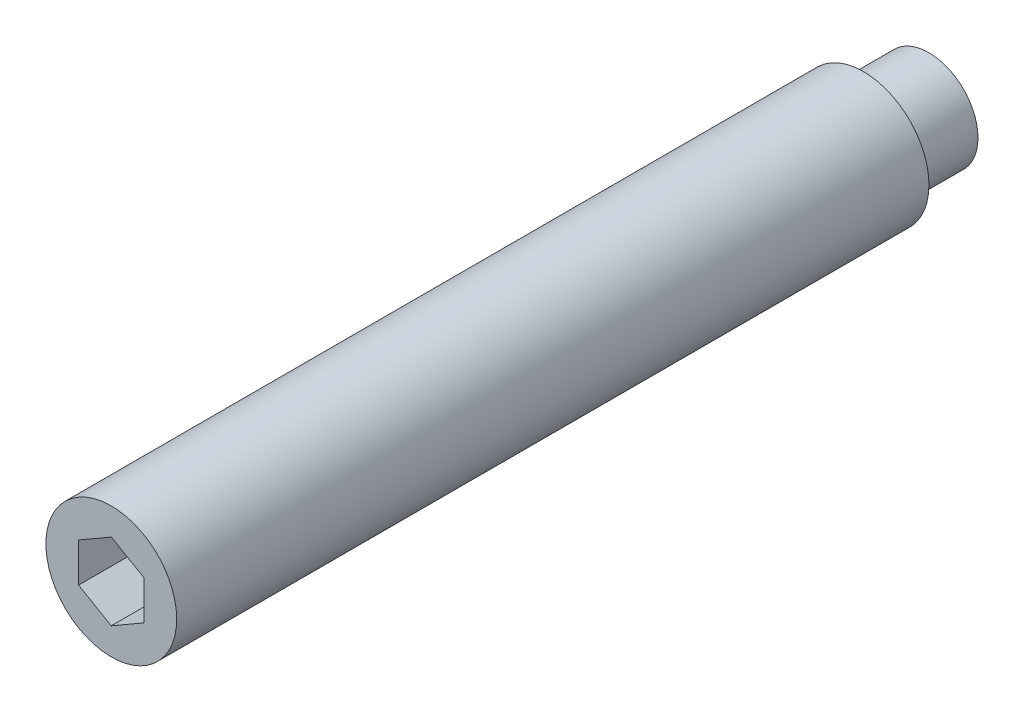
ISO-10303-21;
HEADER;
FILE_DESCRIPTION(('STEP AP214'),'2;1');
FILE_NAME('part.step','',(''),(''),'','','');
FILE_SCHEMA(('AUTOMOTIVE_DESIGN { 1 0 10303 214 1 1 1 1 }'));
ENDSEC;
DATA;
#1=APPLICATION_CONTEXT('core data for automotive mechanical design processes');
#2=APPLICATION_PROTOCOL_DEFINITION('international standard','automotive_design',2000,#1);
#3=PRODUCT_CONTEXT('',#1,'mechanical');
#4=PRODUCT('Part','Part','',(#3));
#5=PRODUCT_RELATED_PRODUCT_CATEGORY('part','',(#4));
#6=PRODUCT_DEFINITION_FORMATION('','',#4);
#7=PRODUCT_DEFINITION_CONTEXT('part definition',#1,'design');
#8=PRODUCT_DEFINITION('design','',#6,#7);
#9=PRODUCT_DEFINITION_SHAPE('','',#8);
#10=(LENGTH_UNIT() NAMED_UNIT(*) SI_UNIT(.MILLI.,.METRE.));
#11=(NAMED_UNIT(*) PLANE_ANGLE_UNIT() SI_UNIT($,.RADIAN.));
#12=(NAMED_UNIT(*) SI_UNIT($,.STERADIAN.) SOLID_ANGLE_UNIT());
#13=UNCERTAINTY_MEASURE_WITH_UNIT(LENGTH_MEASURE(1.E-05),#10,'distance_accuracy_value','');
#14=(GEOMETRIC_REPRESENTATION_CONTEXT(3) GLOBAL_UNCERTAINTY_ASSIGNED_CONTEXT((#13)) GLOBAL_UNIT_ASSIGNED_CONTEXT((#10,
#11,#12)) REPRESENTATION_CONTEXT('',''));
#15=CARTESIAN_POINT('',(0.,0.,0.));
#16=DIRECTION('',(0.,0.,1.));
#17=DIRECTION('',(1.,0.,0.));
#18=AXIS2_PLACEMENT_3D('',#15,#16,#17);
#19=CARTESIAN_POINT('',(0.,4.7,94.));
#20=DIRECTION('',(-0.5,-0.866025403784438,0.));
#21=DIRECTION('',(0.866025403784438,-0.5,0.));
#22=AXIS2_PLACEMENT_3D('',#19,#20,#21);
#23=PLANE('',#22);
#24=DIRECTION('',(0.,0.,1.));
#25=VECTOR('',#24,1.);
#26=CARTESIAN_POINT('',(4.,2.39059892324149,94.));
#27=LINE('',#26,#25);
#28=CARTESIAN_POINT('',(4.,2.39059892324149,94.));
#29=VERTEX_POINT('',#28);
#30=CARTESIAN_POINT('',(4.,2.39059892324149,100.));
#31=VERTEX_POINT('',#30);
#32=EDGE_CURVE('E37',#29,#31,#27,.T.);
#33=ORIENTED_EDGE('',*,*,#32,.T.);
#34=DIRECTION('',(0.866025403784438,-0.5,0.));
#35=VECTOR('',#34,1.);
#36=CARTESIAN_POINT('',(0.,4.7,100.));
#37=LINE('',#36,#35);
#38=CARTESIAN_POINT('',(0.,4.7,100.));
#39=VERTEX_POINT('',#38);
#40=EDGE_CURVE('E29',#39,#31,#37,.T.);
#41=ORIENTED_EDGE('',*,*,#40,.F.);
#42=DIRECTION('',(0.,0.,1.));
#43=VECTOR('',#42,1.);
#44=CARTESIAN_POINT('',(0.,4.7,94.));
#45=LINE('',#44,#43);
#46=CARTESIAN_POINT('',(0.,4.7,94.));
#47=VERTEX_POINT('',#46);
#48=EDGE_CURVE('E93',#47,#39,#45,.T.);
#49=ORIENTED_EDGE('',*,*,#48,.F.);
#50=DIRECTION('',(0.866025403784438,-0.5,0.));
#51=VECTOR('',#50,1.);
#52=CARTESIAN_POINT('',(0.,4.7,94.));
#53=LINE('',#52,#51);
#54=EDGE_CURVE('E96',#47,#29,#53,.T.);
#55=ORIENTED_EDGE('',*,*,#54,.T.);
#56=EDGE_LOOP('',(#33,#41,#49,#55));
#57=FACE_BOUND('',#56,.T.);
#58=ADVANCED_FACE('F14',(#57),#23,.T.);
#59=CARTESIAN_POINT('',(4.,2.39059892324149,94.));
#60=DIRECTION('',(-1.,0.,0.));
#61=DIRECTION('',(0.,0.,1.));
#62=AXIS2_PLACEMENT_3D('',#59,#60,#61);
#63=PLANE('',#62);
#64=DIRECTION('',(0.,0.,1.));
#65=VECTOR('',#64,1.);
#66=CARTESIAN_POINT('',(4.,-2.39059892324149,94.));
#67=LINE('',#66,#65);
#68=CARTESIAN_POINT('',(4.,-2.39059892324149,94.));
#69=VERTEX_POINT('',#68);
#70=CARTESIAN_POINT('',(4.,-2.39059892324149,100.));
#71=VERTEX_POINT('',#70);
#72=EDGE_CURVE('E72',#69,#71,#67,.T.);
#73=ORIENTED_EDGE('',*,*,#72,.T.);
#74=DIRECTION('',(0.,-1.,0.));
#75=VECTOR('',#74,1.);
#76=CARTESIAN_POINT('',(4.,2.39059892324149,100.));
#77=LINE('',#76,#75);
#78=EDGE_CURVE('E234',#31,#71,#77,.T.);
#79=ORIENTED_EDGE('',*,*,#78,.F.);
#80=ORIENTED_EDGE('',*,*,#32,.F.);
#81=DIRECTION('',(0.,-1.,0.));
#82=VECTOR('',#81,1.);
#83=CARTESIAN_POINT('',(4.,2.39059892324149,94.));
#84=LINE('',#83,#82);
#85=EDGE_CURVE('E81',#29,#69,#84,.T.);
#86=ORIENTED_EDGE('',*,*,#85,.T.);
#87=EDGE_LOOP('',(#73,#79,#80,#86));
#88=FACE_BOUND('',#87,.T.);
#89=ADVANCED_FACE('F128',(#88),#63,.T.);
#90=CARTESIAN_POINT('',(0.,-4.7,94.));
#91=DIRECTION('',(0.5,-0.866025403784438,0.));
#92=DIRECTION('',(0.866025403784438,0.5,0.));
#93=AXIS2_PLACEMENT_3D('',#90,#91,#92);
#94=PLANE('',#93);
#95=DIRECTION('',(0.,0.,1.));
#96=VECTOR('',#95,1.);
#97=CARTESIAN_POINT('',(0.,-4.7,94.));
#98=LINE('',#97,#96);
#99=CARTESIAN_POINT('',(0.,-4.7,94.));
#100=VERTEX_POINT('',#99);
#101=CARTESIAN_POINT('',(0.,-4.7,100.));
#102=VERTEX_POINT('',#101);
#103=EDGE_CURVE('E59',#100,#102,#98,.T.);
#104=ORIENTED_EDGE('',*,*,#103,.T.);
#105=DIRECTION('',(0.866025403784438,0.5,0.));
#106=VECTOR('',#105,1.);
#107=CARTESIAN_POINT('',(0.,-4.7,100.));
#108=LINE('',#107,#106);
#109=EDGE_CURVE('E240',#102,#71,#108,.T.);
#110=ORIENTED_EDGE('',*,*,#109,.T.);
#111=ORIENTED_EDGE('',*,*,#72,.F.);
#112=DIRECTION('',(0.866025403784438,0.5,0.));
#113=VECTOR('',#112,1.);
#114=CARTESIAN_POINT('',(0.,-4.7,94.));
#115=LINE('',#114,#113);
#116=EDGE_CURVE('E76',#100,#69,#115,.T.);
#117=ORIENTED_EDGE('',*,*,#116,.F.);
#118=EDGE_LOOP('',(#104,#110,#111,#117));
#119=FACE_BOUND('',#118,.T.);
#120=ADVANCED_FACE('F77',(#119),#94,.F.);
#121=CARTESIAN_POINT('',(0.,-4.7,94.));
#122=DIRECTION('',(0.5,0.866025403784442,0.));
#123=DIRECTION('',(-0.866025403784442,0.5,0.));
#124=AXIS2_PLACEMENT_3D('',#121,#122,#123);
#125=PLANE('',#124);
#126=DIRECTION('',(0.,0.,1.));
#127=VECTOR('',#126,1.);
#128=CARTESIAN_POINT('',(-4.,-2.39059892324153,94.));
#129=LINE('',#128,#127);
#130=CARTESIAN_POINT('',(-4.,-2.39059892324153,94.));
#131=VERTEX_POINT('',#130);
#132=CARTESIAN_POINT('',(-4.,-2.39059892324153,100.));
#133=VERTEX_POINT('',#132);
#134=EDGE_CURVE('E73',#131,#133,#129,.T.);
#135=ORIENTED_EDGE('',*,*,#134,.T.);
#136=DIRECTION('',(-0.866025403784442,0.5,0.));
#137=VECTOR('',#136,1.);
#138=CARTESIAN_POINT('',(0.,-4.7,100.));
#139=LINE('',#138,#137);
#140=EDGE_CURVE('E68',#102,#133,#139,.T.);
#141=ORIENTED_EDGE('',*,*,#140,.F.);
#142=ORIENTED_EDGE('',*,*,#103,.F.);
#143=DIRECTION('',(-0.866025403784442,0.5,0.));
#144=VECTOR('',#143,1.);
#145=CARTESIAN_POINT('',(0.,-4.7,94.));
#146=LINE('',#145,#144);
#147=EDGE_CURVE('E64',#100,#131,#146,.T.);
#148=ORIENTED_EDGE('',*,*,#147,.T.);
#149=EDGE_LOOP('',(#135,#141,#142,#148));
#150=FACE_BOUND('',#149,.T.);
#151=ADVANCED_FACE('F62',(#150),#125,.T.);
#152=CARTESIAN_POINT('',(-4.,2.39059892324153,94.));
#153=DIRECTION('',(-1.,0.,0.));
#154=DIRECTION('',(0.,0.,1.));
#155=AXIS2_PLACEMENT_3D('',#152,#153,#154);
#156=PLANE('',#155);
#157=DIRECTION('',(0.,0.,1.));
#158=VECTOR('',#157,1.);
#159=CARTESIAN_POINT('',(-4.,2.39059892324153,94.));
#160=LINE('',#159,#158);
#161=CARTESIAN_POINT('',(-4.,2.39059892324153,94.));
#162=VERTEX_POINT('',#161);
#163=CARTESIAN_POINT('',(-4.,2.39059892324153,100.));
#164=VERTEX_POINT('',#163);
#165=EDGE_CURVE('E95',#162,#164,#160,.T.);
#166=ORIENTED_EDGE('',*,*,#165,.T.);
#167=DIRECTION('',(0.,-1.,0.));
#168=VECTOR('',#167,1.);
#169=CARTESIAN_POINT('',(-4.,2.39059892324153,100.));
#170=LINE('',#169,#168);
#171=EDGE_CURVE('E245',#164,#133,#170,.T.);
#172=ORIENTED_EDGE('',*,*,#171,.T.);
#173=ORIENTED_EDGE('',*,*,#134,.F.);
#174=DIRECTION('',(0.,-1.,0.));
#175=VECTOR('',#174,1.);
#176=CARTESIAN_POINT('',(-4.,2.39059892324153,94.));
#177=LINE('',#176,#175);
#178=EDGE_CURVE('E87',#162,#131,#177,.T.);
#179=ORIENTED_EDGE('',*,*,#178,.F.);
#180=EDGE_LOOP('',(#166,#172,#173,#179));
#181=FACE_BOUND('',#180,.T.);
#182=ADVANCED_FACE('F139',(#181),#156,.F.);
#183=CARTESIAN_POINT('',(0.,4.7,94.));
#184=DIRECTION('',(-0.499999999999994,0.866025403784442,0.));
#185=DIRECTION('',(-0.866025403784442,-0.499999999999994,0.));
#186=AXIS2_PLACEMENT_3D('',#183,#184,#185);
#187=PLANE('',#186);
#188=DIRECTION('',(-0.866025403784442,-0.499999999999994,0.));
#189=VECTOR('',#188,1.);
#190=CARTESIAN_POINT('',(0.,4.7,94.));
#191=LINE('',#190,#189);
#192=EDGE_CURVE('E89',#47,#162,#191,.T.);
#193=ORIENTED_EDGE('',*,*,#192,.F.);
#194=ORIENTED_EDGE('',*,*,#48,.T.);
#195=DIRECTION('',(-0.866025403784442,-0.499999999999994,0.));
#196=VECTOR('',#195,1.);
#197=CARTESIAN_POINT('',(0.,4.7,100.));
#198=LINE('',#197,#196);
#199=EDGE_CURVE('E237',#39,#164,#198,.T.);
#200=ORIENTED_EDGE('',*,*,#199,.T.);
#201=ORIENTED_EDGE('',*,*,#165,.F.);
#202=EDGE_LOOP('',(#193,#194,#200,#201));
#203=FACE_BOUND('',#202,.T.);
#204=ADVANCED_FACE('F126',(#203),#187,.F.);
#205=CARTESIAN_POINT('',(8.1406387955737,0.,94.));
#206=DIRECTION('',(0.,0.,1.));
#207=DIRECTION('',(1.,0.,0.));
#208=AXIS2_PLACEMENT_3D('',#205,#206,#207);
#209=PLANE('',#208);
#210=ORIENTED_EDGE('',*,*,#54,.F.);
#211=ORIENTED_EDGE('',*,*,#192,.T.);
#212=ORIENTED_EDGE('',*,*,#178,.T.);
#213=ORIENTED_EDGE('',*,*,#147,.F.);
#214=ORIENTED_EDGE('',*,*,#116,.T.);
#215=ORIENTED_EDGE('',*,*,#85,.F.);
#216=EDGE_LOOP('',(#210,#211,#212,#213,#214,#215));
#217=FACE_BOUND('',#216,.T.);
#218=ADVANCED_FACE('F84',(#217),#209,.T.);
#219=CARTESIAN_POINT('',(8.,0.,100.));
#220=DIRECTION('',(0.,0.,-1.));
#221=DIRECTION('',(-1.,0.,0.));
#222=AXIS2_PLACEMENT_3D('',#219,#220,#221);
#223=PLANE('',#222);
#224=CARTESIAN_POINT('',(0.,0.,100.));
#225=DIRECTION('',(0.,0.,1.));
#226=DIRECTION('',(1.,0.,0.));
#227=AXIS2_PLACEMENT_3D('',#224,#225,#226);
#228=CIRCLE('',#227,8.);
#229=CARTESIAN_POINT('',(8.,0.,100.));
#230=VERTEX_POINT('',#229);
#231=EDGE_CURVE('E102',#230,#230,#228,.T.);
#232=ORIENTED_EDGE('',*,*,#231,.T.);
#233=EDGE_LOOP('',(#232));
#234=FACE_BOUND('',#233,.T.);
#235=ORIENTED_EDGE('',*,*,#40,.T.);
#236=ORIENTED_EDGE('',*,*,#78,.T.);
#237=ORIENTED_EDGE('',*,*,#109,.F.);
#238=ORIENTED_EDGE('',*,*,#140,.T.);
#239=ORIENTED_EDGE('',*,*,#171,.F.);
#240=ORIENTED_EDGE('',*,*,#199,.F.);
#241=EDGE_LOOP('',(#235,#236,#237,#238,#239,#240));
#242=FACE_BOUND('',#241,.T.);
#243=ADVANCED_FACE('F118',(#234,#242),#223,.F.);
#244=CARTESIAN_POINT('',(0.,0.,0.));
#245=DIRECTION('',(0.,0.,1.));
#246=DIRECTION('',(1.,0.,0.));
#247=AXIS2_PLACEMENT_3D('',#244,#245,#246);
#248=PLANE('',#247);
#249=CARTESIAN_POINT('',(0.,0.,0.));
#250=DIRECTION('',(0.,0.,1.));
#251=DIRECTION('',(1.,0.,0.));
#252=AXIS2_PLACEMENT_3D('',#249,#250,#251);
#253=CIRCLE('',#252,6.);
#254=CARTESIAN_POINT('',(6.,0.,0.));
#255=VERTEX_POINT('',#254);
#256=EDGE_CURVE('E9',#255,#255,#253,.T.);
#257=ORIENTED_EDGE('',*,*,#256,.F.);
#258=EDGE_LOOP('',(#257));
#259=FACE_BOUND('',#258,.T.);
#260=ADVANCED_FACE('F16',(#259),#248,.F.);
#261=CARTESIAN_POINT('',(0.,0.,110.));
#262=DIRECTION('',(0.,0.,1.));
#263=DIRECTION('',(1.,0.,0.));
#264=AXIS2_PLACEMENT_3D('',#261,#262,#263);
#265=CYLINDRICAL_SURFACE('',#264,6.);
#266=CARTESIAN_POINT('',(0.,0.,8.));
#267=DIRECTION('',(0.,0.,1.));
#268=DIRECTION('',(1.,0.,0.));
#269=AXIS2_PLACEMENT_3D('',#266,#267,#268);
#270=CIRCLE('',#269,6.);
#271=CARTESIAN_POINT('',(6.,0.,8.));
#272=VERTEX_POINT('',#271);
#273=EDGE_CURVE('E22',#272,#272,#270,.T.);
#274=ORIENTED_EDGE('',*,*,#273,.F.);
#275=EDGE_LOOP('',(#274));
#276=FACE_BOUND('',#275,.T.);
#277=ORIENTED_EDGE('',*,*,#256,.T.);
#278=EDGE_LOOP('',(#277));
#279=FACE_BOUND('',#278,.T.);
#280=ADVANCED_FACE('F112',(#276,#279),#265,.T.);
#281=CARTESIAN_POINT('',(6.,0.,8.));
#282=DIRECTION('',(0.,0.,1.));
#283=DIRECTION('',(1.,0.,0.));
#284=AXIS2_PLACEMENT_3D('',#281,#282,#283);
#285=PLANE('',#284);
#286=CARTESIAN_POINT('',(0.,0.,8.));
#287=DIRECTION('',(0.,0.,1.));
#288=DIRECTION('',(1.,0.,0.));
#289=AXIS2_PLACEMENT_3D('',#286,#287,#288);
#290=CIRCLE('',#289,8.);
#291=CARTESIAN_POINT('',(8.,0.,8.));
#292=VERTEX_POINT('',#291);
#293=EDGE_CURVE('E105',#292,#292,#290,.T.);
#294=ORIENTED_EDGE('',*,*,#293,.F.);
#295=EDGE_LOOP('',(#294));
#296=FACE_BOUND('',#295,.T.);
#297=ORIENTED_EDGE('',*,*,#273,.T.);
#298=EDGE_LOOP('',(#297));
#299=FACE_BOUND('',#298,.T.);
#300=ADVANCED_FACE('F110',(#296,#299),#285,.F.);
#301=CARTESIAN_POINT('',(0.,0.,110.));
#302=DIRECTION('',(0.,0.,1.));
#303=DIRECTION('',(1.,0.,0.));
#304=AXIS2_PLACEMENT_3D('',#301,#302,#303);
#305=CYLINDRICAL_SURFACE('',#304,8.);
#306=ORIENTED_EDGE('',*,*,#231,.F.);
#307=EDGE_LOOP('',(#306));
#308=FACE_BOUND('',#307,.T.);
#309=ORIENTED_EDGE('',*,*,#293,.T.);
#310=EDGE_LOOP('',(#309));
#311=FACE_BOUND('',#310,.T.);
#312=ADVANCED_FACE('F148',(#308,#311),#305,.T.);
#313=CLOSED_SHELL('',(#58,#89,#120,#151,#182,#204,#218,#243,#260,#280,#300,#312));
#314=MANIFOLD_SOLID_BREP('B1',#313);
#315=ADVANCED_BREP_SHAPE_REPRESENTATION('',(#18,#314),#14);
#316=SHAPE_DEFINITION_REPRESENTATION(#9,#315);
ENDSEC;
END-ISO-10303-21;
